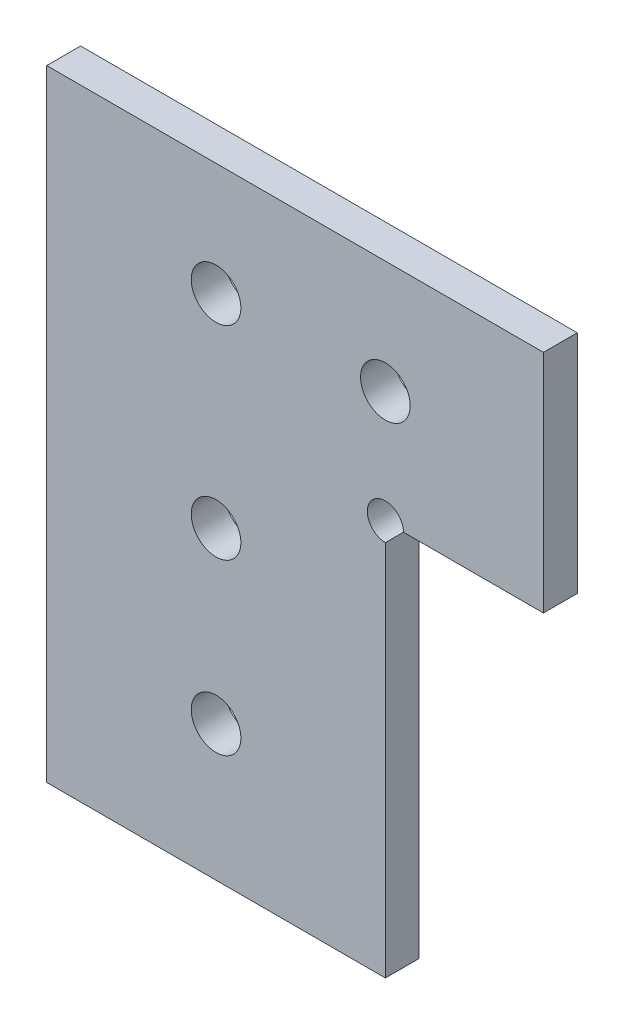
ISO-10303-21;
HEADER;
FILE_DESCRIPTION(('STEP AP214'),'2;1');
FILE_NAME('part.step','',(''),(''),'','','');
FILE_SCHEMA(('AUTOMOTIVE_DESIGN { 1 0 10303 214 1 1 1 1 }'));
ENDSEC;
DATA;
#1=APPLICATION_CONTEXT('core data for automotive mechanical design processes');
#2=APPLICATION_PROTOCOL_DEFINITION('international standard','automotive_design',2000,#1);
#3=PRODUCT_CONTEXT('',#1,'mechanical');
#4=PRODUCT('Part','Part','',(#3));
#5=PRODUCT_RELATED_PRODUCT_CATEGORY('part','',(#4));
#6=PRODUCT_DEFINITION_FORMATION('','',#4);
#7=PRODUCT_DEFINITION_CONTEXT('part definition',#1,'design');
#8=PRODUCT_DEFINITION('design','',#6,#7);
#9=PRODUCT_DEFINITION_SHAPE('','',#8);
#10=(LENGTH_UNIT() NAMED_UNIT(*) SI_UNIT(.MILLI.,.METRE.));
#11=(NAMED_UNIT(*) PLANE_ANGLE_UNIT() SI_UNIT($,.RADIAN.));
#12=(NAMED_UNIT(*) SI_UNIT($,.STERADIAN.) SOLID_ANGLE_UNIT());
#13=UNCERTAINTY_MEASURE_WITH_UNIT(LENGTH_MEASURE(1.E-05),#10,'distance_accuracy_value','');
#14=(GEOMETRIC_REPRESENTATION_CONTEXT(3) GLOBAL_UNCERTAINTY_ASSIGNED_CONTEXT((#13)) GLOBAL_UNIT_ASSIGNED_CONTEXT((#10,
#11,#12)) REPRESENTATION_CONTEXT('',''));
#15=CARTESIAN_POINT('',(0.,0.,0.));
#16=DIRECTION('',(0.,0.,1.));
#17=DIRECTION('',(1.,0.,0.));
#18=AXIS2_PLACEMENT_3D('',#15,#16,#17);
#19=CARTESIAN_POINT('',(30.,35.,0.));
#20=DIRECTION('',(0.,0.,1.));
#21=DIRECTION('',(1.,0.,0.));
#22=AXIS2_PLACEMENT_3D('',#19,#20,#21);
#23=CYLINDRICAL_SURFACE('',#22,1.6);
#24=CARTESIAN_POINT('',(30.,35.,3.));
#25=DIRECTION('',(0.,0.,1.));
#26=DIRECTION('',(1.,0.,0.));
#27=AXIS2_PLACEMENT_3D('',#24,#25,#26);
#28=CIRCLE('',#27,1.6);
#29=CARTESIAN_POINT('',(31.6,35.,3.));
#30=VERTEX_POINT('',#29);
#31=CARTESIAN_POINT('',(30.,33.4,3.));
#32=VERTEX_POINT('',#31);
#33=EDGE_CURVE('E20',#30,#32,#28,.T.);
#34=ORIENTED_EDGE('',*,*,#33,.T.);
#35=DIRECTION('',(0.,0.,1.));
#36=VECTOR('',#35,1.);
#37=CARTESIAN_POINT('',(30.,33.4,0.));
#38=LINE('',#37,#36);
#39=CARTESIAN_POINT('',(30.,33.4,0.));
#40=VERTEX_POINT('',#39);
#41=EDGE_CURVE('E84',#40,#32,#38,.T.);
#42=ORIENTED_EDGE('',*,*,#41,.F.);
#43=CARTESIAN_POINT('',(30.,35.,0.));
#44=DIRECTION('',(0.,0.,1.));
#45=DIRECTION('',(1.,0.,0.));
#46=AXIS2_PLACEMENT_3D('',#43,#44,#45);
#47=CIRCLE('',#46,1.6);
#48=CARTESIAN_POINT('',(31.6,35.,0.));
#49=VERTEX_POINT('',#48);
#50=EDGE_CURVE('E11',#49,#40,#47,.T.);
#51=ORIENTED_EDGE('',*,*,#50,.F.);
#52=DIRECTION('',(0.,0.,-1.));
#53=VECTOR('',#52,1.);
#54=CARTESIAN_POINT('',(31.6,35.,0.));
#55=LINE('',#54,#53);
#56=EDGE_CURVE('E214',#30,#49,#55,.T.);
#57=ORIENTED_EDGE('',*,*,#56,.F.);
#58=EDGE_LOOP('',(#34,#42,#51,#57));
#59=FACE_BOUND('',#58,.T.);
#60=ADVANCED_FACE('F17',(#59),#23,.F.);
#61=CARTESIAN_POINT('',(0.,0.,0.));
#62=DIRECTION('',(0.,0.,1.));
#63=DIRECTION('',(1.,0.,0.));
#64=AXIS2_PLACEMENT_3D('',#61,#62,#63);
#65=PLANE('',#64);
#66=CARTESIAN_POINT('',(15.,27.,0.));
#67=DIRECTION('',(0.,0.,1.));
#68=DIRECTION('',(1.,0.,0.));
#69=AXIS2_PLACEMENT_3D('',#66,#67,#68);
#70=CIRCLE('',#69,2.2);
#71=CARTESIAN_POINT('',(17.2,27.,0.));
#72=VERTEX_POINT('',#71);
#73=EDGE_CURVE('E299',#72,#72,#70,.T.);
#74=ORIENTED_EDGE('',*,*,#73,.T.);
#75=EDGE_LOOP('',(#74));
#76=FACE_BOUND('',#75,.T.);
#77=CARTESIAN_POINT('',(15.,12.,0.));
#78=DIRECTION('',(0.,0.,1.));
#79=DIRECTION('',(1.,0.,0.));
#80=AXIS2_PLACEMENT_3D('',#77,#78,#79);
#81=CIRCLE('',#80,2.2);
#82=CARTESIAN_POINT('',(17.2,12.,0.));
#83=VERTEX_POINT('',#82);
#84=EDGE_CURVE('E225',#83,#83,#81,.T.);
#85=ORIENTED_EDGE('',*,*,#84,.T.);
#86=EDGE_LOOP('',(#85));
#87=FACE_BOUND('',#86,.T.);
#88=CARTESIAN_POINT('',(15.,45.,0.));
#89=DIRECTION('',(0.,0.,1.));
#90=DIRECTION('',(1.,0.,0.));
#91=AXIS2_PLACEMENT_3D('',#88,#89,#90);
#92=CIRCLE('',#91,2.2);
#93=CARTESIAN_POINT('',(17.2,45.,0.));
#94=VERTEX_POINT('',#93);
#95=EDGE_CURVE('E255',#94,#94,#92,.T.);
#96=ORIENTED_EDGE('',*,*,#95,.T.);
#97=EDGE_LOOP('',(#96));
#98=FACE_BOUND('',#97,.T.);
#99=CARTESIAN_POINT('',(30.,45.,0.));
#100=DIRECTION('',(0.,0.,1.));
#101=DIRECTION('',(1.,0.,0.));
#102=AXIS2_PLACEMENT_3D('',#99,#100,#101);
#103=CIRCLE('',#102,2.2);
#104=CARTESIAN_POINT('',(32.2,45.,0.));
#105=VERTEX_POINT('',#104);
#106=EDGE_CURVE('E283',#105,#105,#103,.T.);
#107=ORIENTED_EDGE('',*,*,#106,.T.);
#108=EDGE_LOOP('',(#107));
#109=FACE_BOUND('',#108,.T.);
#110=DIRECTION('',(1.,0.,0.));
#111=VECTOR('',#110,1.);
#112=CARTESIAN_POINT('',(0.,35.,0.));
#113=LINE('',#112,#111);
#114=CARTESIAN_POINT('',(44.,35.,0.));
#115=VERTEX_POINT('',#114);
#116=EDGE_CURVE('E205',#49,#115,#113,.T.);
#117=ORIENTED_EDGE('',*,*,#116,.F.);
#118=ORIENTED_EDGE('',*,*,#50,.T.);
#119=DIRECTION('',(0.,1.,0.));
#120=VECTOR('',#119,1.);
#121=CARTESIAN_POINT('',(30.,0.,0.));
#122=LINE('',#121,#120);
#123=CARTESIAN_POINT('',(30.,0.,0.));
#124=VERTEX_POINT('',#123);
#125=EDGE_CURVE('E97',#124,#40,#122,.T.);
#126=ORIENTED_EDGE('',*,*,#125,.F.);
#127=DIRECTION('',(1.,0.,0.));
#128=VECTOR('',#127,1.);
#129=CARTESIAN_POINT('',(0.,0.,0.));
#130=LINE('',#129,#128);
#131=CARTESIAN_POINT('',(0.,0.,0.));
#132=VERTEX_POINT('',#131);
#133=EDGE_CURVE('E100',#132,#124,#130,.T.);
#134=ORIENTED_EDGE('',*,*,#133,.F.);
#135=DIRECTION('',(0.,1.,0.));
#136=VECTOR('',#135,1.);
#137=CARTESIAN_POINT('',(0.,0.,0.));
#138=LINE('',#137,#136);
#139=CARTESIAN_POINT('',(0.,55.,0.));
#140=VERTEX_POINT('',#139);
#141=EDGE_CURVE('E150',#132,#140,#138,.T.);
#142=ORIENTED_EDGE('',*,*,#141,.T.);
#143=DIRECTION('',(1.,0.,0.));
#144=VECTOR('',#143,1.);
#145=CARTESIAN_POINT('',(0.,55.,0.));
#146=LINE('',#145,#144);
#147=CARTESIAN_POINT('',(44.,55.,0.));
#148=VERTEX_POINT('',#147);
#149=EDGE_CURVE('E163',#140,#148,#146,.T.);
#150=ORIENTED_EDGE('',*,*,#149,.T.);
#151=DIRECTION('',(0.,1.,0.));
#152=VECTOR('',#151,1.);
#153=CARTESIAN_POINT('',(44.,0.,0.));
#154=LINE('',#153,#152);
#155=EDGE_CURVE('E187',#115,#148,#154,.T.);
#156=ORIENTED_EDGE('',*,*,#155,.F.);
#157=EDGE_LOOP('',(#117,#118,#126,#134,#142,#150,#156));
#158=FACE_BOUND('',#157,.T.);
#159=ADVANCED_FACE('F369',(#76,#87,#98,#109,#158),#65,.F.);
#160=CARTESIAN_POINT('',(0.,0.,3.));
#161=DIRECTION('',(0.,0.,1.));
#162=DIRECTION('',(1.,0.,0.));
#163=AXIS2_PLACEMENT_3D('',#160,#161,#162);
#164=PLANE('',#163);
#165=CARTESIAN_POINT('',(15.,27.,3.));
#166=DIRECTION('',(0.,0.,1.));
#167=DIRECTION('',(1.,0.,0.));
#168=AXIS2_PLACEMENT_3D('',#165,#166,#167);
#169=CIRCLE('',#168,2.2);
#170=CARTESIAN_POINT('',(17.2,27.,3.));
#171=VERTEX_POINT('',#170);
#172=EDGE_CURVE('E309',#171,#171,#169,.T.);
#173=ORIENTED_EDGE('',*,*,#172,.F.);
#174=EDGE_LOOP('',(#173));
#175=FACE_BOUND('',#174,.T.);
#176=CARTESIAN_POINT('',(15.,12.,3.));
#177=DIRECTION('',(0.,0.,1.));
#178=DIRECTION('',(1.,0.,0.));
#179=AXIS2_PLACEMENT_3D('',#176,#177,#178);
#180=CIRCLE('',#179,2.2);
#181=CARTESIAN_POINT('',(17.2,12.,3.));
#182=VERTEX_POINT('',#181);
#183=EDGE_CURVE('E241',#182,#182,#180,.T.);
#184=ORIENTED_EDGE('',*,*,#183,.F.);
#185=EDGE_LOOP('',(#184));
#186=FACE_BOUND('',#185,.T.);
#187=CARTESIAN_POINT('',(15.,45.,3.));
#188=DIRECTION('',(0.,0.,1.));
#189=DIRECTION('',(1.,0.,0.));
#190=AXIS2_PLACEMENT_3D('',#187,#188,#189);
#191=CIRCLE('',#190,2.2);
#192=CARTESIAN_POINT('',(17.2,45.,3.));
#193=VERTEX_POINT('',#192);
#194=EDGE_CURVE('E265',#193,#193,#191,.T.);
#195=ORIENTED_EDGE('',*,*,#194,.F.);
#196=EDGE_LOOP('',(#195));
#197=FACE_BOUND('',#196,.T.);
#198=CARTESIAN_POINT('',(30.,45.,3.));
#199=DIRECTION('',(0.,0.,1.));
#200=DIRECTION('',(1.,0.,0.));
#201=AXIS2_PLACEMENT_3D('',#198,#199,#200);
#202=CIRCLE('',#201,2.2);
#203=CARTESIAN_POINT('',(32.2,45.,3.));
#204=VERTEX_POINT('',#203);
#205=EDGE_CURVE('E289',#204,#204,#202,.T.);
#206=ORIENTED_EDGE('',*,*,#205,.F.);
#207=EDGE_LOOP('',(#206));
#208=FACE_BOUND('',#207,.T.);
#209=ORIENTED_EDGE('',*,*,#33,.F.);
#210=DIRECTION('',(1.,0.,0.));
#211=VECTOR('',#210,1.);
#212=CARTESIAN_POINT('',(0.,35.,3.));
#213=LINE('',#212,#211);
#214=CARTESIAN_POINT('',(44.,35.,3.));
#215=VERTEX_POINT('',#214);
#216=EDGE_CURVE('E220',#30,#215,#213,.T.);
#217=ORIENTED_EDGE('',*,*,#216,.T.);
#218=DIRECTION('',(0.,1.,0.));
#219=VECTOR('',#218,1.);
#220=CARTESIAN_POINT('',(44.,0.,3.));
#221=LINE('',#220,#219);
#222=CARTESIAN_POINT('',(44.,55.,3.));
#223=VERTEX_POINT('',#222);
#224=EDGE_CURVE('E168',#215,#223,#221,.T.);
#225=ORIENTED_EDGE('',*,*,#224,.T.);
#226=DIRECTION('',(1.,0.,0.));
#227=VECTOR('',#226,1.);
#228=CARTESIAN_POINT('',(0.,55.,3.));
#229=LINE('',#228,#227);
#230=CARTESIAN_POINT('',(0.,55.,3.));
#231=VERTEX_POINT('',#230);
#232=EDGE_CURVE('E157',#231,#223,#229,.T.);
#233=ORIENTED_EDGE('',*,*,#232,.F.);
#234=DIRECTION('',(0.,1.,0.));
#235=VECTOR('',#234,1.);
#236=CARTESIAN_POINT('',(0.,0.,3.));
#237=LINE('',#236,#235);
#238=CARTESIAN_POINT('',(0.,0.,3.));
#239=VERTEX_POINT('',#238);
#240=EDGE_CURVE('E92',#239,#231,#237,.T.);
#241=ORIENTED_EDGE('',*,*,#240,.F.);
#242=DIRECTION('',(1.,0.,0.));
#243=VECTOR('',#242,1.);
#244=CARTESIAN_POINT('',(0.,0.,3.));
#245=LINE('',#244,#243);
#246=CARTESIAN_POINT('',(30.,0.,3.));
#247=VERTEX_POINT('',#246);
#248=EDGE_CURVE('E89',#239,#247,#245,.T.);
#249=ORIENTED_EDGE('',*,*,#248,.T.);
#250=DIRECTION('',(0.,1.,0.));
#251=VECTOR('',#250,1.);
#252=CARTESIAN_POINT('',(30.,0.,3.));
#253=LINE('',#252,#251);
#254=EDGE_CURVE('E77',#247,#32,#253,.T.);
#255=ORIENTED_EDGE('',*,*,#254,.T.);
#256=EDGE_LOOP('',(#209,#217,#225,#233,#241,#249,#255));
#257=FACE_BOUND('',#256,.T.);
#258=ADVANCED_FACE('F90',(#175,#186,#197,#208,#257),#164,.T.);
#259=CARTESIAN_POINT('',(30.,0.,3.));
#260=DIRECTION('',(-1.,0.,0.));
#261=DIRECTION('',(0.,0.,1.));
#262=AXIS2_PLACEMENT_3D('',#259,#260,#261);
#263=PLANE('',#262);
#264=ORIENTED_EDGE('',*,*,#125,.T.);
#265=ORIENTED_EDGE('',*,*,#41,.T.);
#266=ORIENTED_EDGE('',*,*,#254,.F.);
#267=DIRECTION('',(0.,0.,-1.));
#268=VECTOR('',#267,1.);
#269=CARTESIAN_POINT('',(30.,0.,3.));
#270=LINE('',#269,#268);
#271=EDGE_CURVE('E82',#247,#124,#270,.T.);
#272=ORIENTED_EDGE('',*,*,#271,.T.);
#273=EDGE_LOOP('',(#264,#265,#266,#272));
#274=FACE_BOUND('',#273,.T.);
#275=ADVANCED_FACE('F80',(#274),#263,.F.);
#276=CARTESIAN_POINT('',(0.,0.,3.));
#277=DIRECTION('',(0.,1.,0.));
#278=DIRECTION('',(1.,0.,0.));
#279=AXIS2_PLACEMENT_3D('',#276,#277,#278);
#280=PLANE('',#279);
#281=ORIENTED_EDGE('',*,*,#133,.T.);
#282=ORIENTED_EDGE('',*,*,#271,.F.);
#283=ORIENTED_EDGE('',*,*,#248,.F.);
#284=DIRECTION('',(0.,0.,-1.));
#285=VECTOR('',#284,1.);
#286=CARTESIAN_POINT('',(0.,0.,3.));
#287=LINE('',#286,#285);
#288=EDGE_CURVE('E143',#239,#132,#287,.T.);
#289=ORIENTED_EDGE('',*,*,#288,.T.);
#290=EDGE_LOOP('',(#281,#282,#283,#289));
#291=FACE_BOUND('',#290,.T.);
#292=ADVANCED_FACE('F99',(#291),#280,.F.);
#293=CARTESIAN_POINT('',(0.,0.,3.));
#294=DIRECTION('',(-1.,0.,0.));
#295=DIRECTION('',(0.,0.,1.));
#296=AXIS2_PLACEMENT_3D('',#293,#294,#295);
#297=PLANE('',#296);
#298=ORIENTED_EDGE('',*,*,#141,.F.);
#299=ORIENTED_EDGE('',*,*,#288,.F.);
#300=ORIENTED_EDGE('',*,*,#240,.T.);
#301=DIRECTION('',(0.,0.,-1.));
#302=VECTOR('',#301,1.);
#303=CARTESIAN_POINT('',(0.,55.,3.));
#304=LINE('',#303,#302);
#305=EDGE_CURVE('E167',#231,#140,#304,.T.);
#306=ORIENTED_EDGE('',*,*,#305,.T.);
#307=EDGE_LOOP('',(#298,#299,#300,#306));
#308=FACE_BOUND('',#307,.T.);
#309=ADVANCED_FACE('F398',(#308),#297,.T.);
#310=CARTESIAN_POINT('',(0.,55.,3.));
#311=DIRECTION('',(0.,1.,0.));
#312=DIRECTION('',(1.,0.,0.));
#313=AXIS2_PLACEMENT_3D('',#310,#311,#312);
#314=PLANE('',#313);
#315=ORIENTED_EDGE('',*,*,#149,.F.);
#316=ORIENTED_EDGE('',*,*,#305,.F.);
#317=ORIENTED_EDGE('',*,*,#232,.T.);
#318=DIRECTION('',(0.,0.,-1.));
#319=VECTOR('',#318,1.);
#320=CARTESIAN_POINT('',(44.,55.,3.));
#321=LINE('',#320,#319);
#322=EDGE_CURVE('E178',#223,#148,#321,.T.);
#323=ORIENTED_EDGE('',*,*,#322,.T.);
#324=EDGE_LOOP('',(#315,#316,#317,#323));
#325=FACE_BOUND('',#324,.T.);
#326=ADVANCED_FACE('F363',(#325),#314,.T.);
#327=CARTESIAN_POINT('',(44.,0.,3.));
#328=DIRECTION('',(-1.,0.,0.));
#329=DIRECTION('',(0.,0.,1.));
#330=AXIS2_PLACEMENT_3D('',#327,#328,#329);
#331=PLANE('',#330);
#332=ORIENTED_EDGE('',*,*,#155,.T.);
#333=ORIENTED_EDGE('',*,*,#322,.F.);
#334=ORIENTED_EDGE('',*,*,#224,.F.);
#335=DIRECTION('',(0.,0.,-1.));
#336=VECTOR('',#335,1.);
#337=CARTESIAN_POINT('',(44.,35.,3.));
#338=LINE('',#337,#336);
#339=EDGE_CURVE('E196',#215,#115,#338,.T.);
#340=ORIENTED_EDGE('',*,*,#339,.T.);
#341=EDGE_LOOP('',(#332,#333,#334,#340));
#342=FACE_BOUND('',#341,.T.);
#343=ADVANCED_FACE('F366',(#342),#331,.F.);
#344=CARTESIAN_POINT('',(0.,35.,3.));
#345=DIRECTION('',(0.,1.,0.));
#346=DIRECTION('',(1.,0.,0.));
#347=AXIS2_PLACEMENT_3D('',#344,#345,#346);
#348=PLANE('',#347);
#349=ORIENTED_EDGE('',*,*,#216,.F.);
#350=ORIENTED_EDGE('',*,*,#56,.T.);
#351=ORIENTED_EDGE('',*,*,#116,.T.);
#352=ORIENTED_EDGE('',*,*,#339,.F.);
#353=EDGE_LOOP('',(#349,#350,#351,#352));
#354=FACE_BOUND('',#353,.T.);
#355=ADVANCED_FACE('F341',(#354),#348,.F.);
#356=CARTESIAN_POINT('',(15.,12.,3.));
#357=DIRECTION('',(0.,0.,-1.));
#358=DIRECTION('',(-1.,0.,0.));
#359=AXIS2_PLACEMENT_3D('',#356,#357,#358);
#360=CYLINDRICAL_SURFACE('',#359,2.2);
#361=ORIENTED_EDGE('',*,*,#84,.F.);
#362=EDGE_LOOP('',(#361));
#363=FACE_BOUND('',#362,.T.);
#364=ORIENTED_EDGE('',*,*,#183,.T.);
#365=EDGE_LOOP('',(#364));
#366=FACE_BOUND('',#365,.T.);
#367=ADVANCED_FACE('F436',(#363,#366),#360,.F.);
#368=CARTESIAN_POINT('',(15.,45.,3.));
#369=DIRECTION('',(0.,0.,-1.));
#370=DIRECTION('',(-1.,0.,0.));
#371=AXIS2_PLACEMENT_3D('',#368,#369,#370);
#372=CYLINDRICAL_SURFACE('',#371,2.2);
#373=ORIENTED_EDGE('',*,*,#95,.F.);
#374=EDGE_LOOP('',(#373));
#375=FACE_BOUND('',#374,.T.);
#376=ORIENTED_EDGE('',*,*,#194,.T.);
#377=EDGE_LOOP('',(#376));
#378=FACE_BOUND('',#377,.T.);
#379=ADVANCED_FACE('F444',(#375,#378),#372,.F.);
#380=CARTESIAN_POINT('',(30.,45.,3.));
#381=DIRECTION('',(0.,0.,-1.));
#382=DIRECTION('',(-1.,0.,0.));
#383=AXIS2_PLACEMENT_3D('',#380,#381,#382);
#384=CYLINDRICAL_SURFACE('',#383,2.19999999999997);
#385=ORIENTED_EDGE('',*,*,#106,.F.);
#386=EDGE_LOOP('',(#385));
#387=FACE_BOUND('',#386,.T.);
#388=ORIENTED_EDGE('',*,*,#205,.T.);
#389=EDGE_LOOP('',(#388));
#390=FACE_BOUND('',#389,.T.);
#391=ADVANCED_FACE('F453',(#387,#390),#384,.F.);
#392=CARTESIAN_POINT('',(15.,27.,3.));
#393=DIRECTION('',(0.,0.,-1.));
#394=DIRECTION('',(-1.,0.,0.));
#395=AXIS2_PLACEMENT_3D('',#392,#393,#394);
#396=CYLINDRICAL_SURFACE('',#395,2.2);
#397=ORIENTED_EDGE('',*,*,#73,.F.);
#398=EDGE_LOOP('',(#397));
#399=FACE_BOUND('',#398,.T.);
#400=ORIENTED_EDGE('',*,*,#172,.T.);
#401=EDGE_LOOP('',(#400));
#402=FACE_BOUND('',#401,.T.);
#403=ADVANCED_FACE('F462',(#399,#402),#396,.F.);
#404=CLOSED_SHELL('',(#60,#159,#258,#275,#292,#309,#326,#343,#355,#367,#379,#391,#403));
#405=MANIFOLD_SOLID_BREP('B1',#404);
#406=ADVANCED_BREP_SHAPE_REPRESENTATION('',(#18,#405),#14);
#407=SHAPE_DEFINITION_REPRESENTATION(#9,#406);
ENDSEC;
END-ISO-10303-21;
